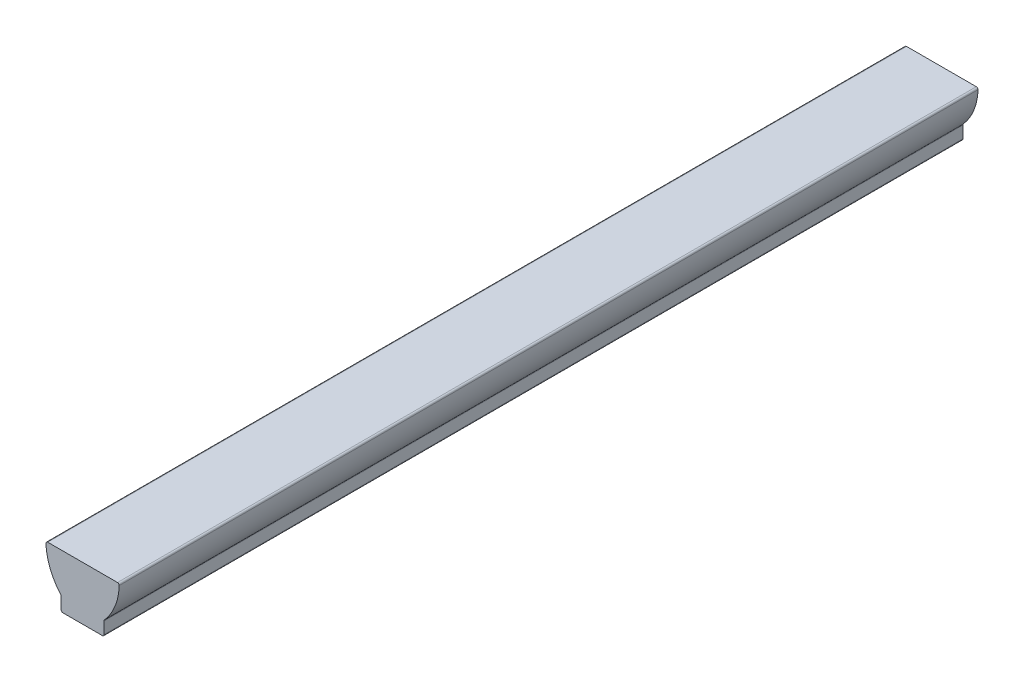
ISO-10303-21;
HEADER;
FILE_DESCRIPTION(('STEP AP214'),'2;1');
FILE_NAME('part.step','',(''),(''),'','','');
FILE_SCHEMA(('AUTOMOTIVE_DESIGN { 1 0 10303 214 1 1 1 1 }'));
ENDSEC;
DATA;
#1=APPLICATION_CONTEXT('core data for automotive mechanical design processes');
#2=APPLICATION_PROTOCOL_DEFINITION('international standard','automotive_design',2000,#1);
#3=PRODUCT_CONTEXT('',#1,'mechanical');
#4=PRODUCT('Part','Part','',(#3));
#5=PRODUCT_RELATED_PRODUCT_CATEGORY('part','',(#4));
#6=PRODUCT_DEFINITION_FORMATION('','',#4);
#7=PRODUCT_DEFINITION_CONTEXT('part definition',#1,'design');
#8=PRODUCT_DEFINITION('design','',#6,#7);
#9=PRODUCT_DEFINITION_SHAPE('','',#8);
#10=(LENGTH_UNIT() NAMED_UNIT(*) SI_UNIT(.MILLI.,.METRE.));
#11=(NAMED_UNIT(*) PLANE_ANGLE_UNIT() SI_UNIT($,.RADIAN.));
#12=(NAMED_UNIT(*) SI_UNIT($,.STERADIAN.) SOLID_ANGLE_UNIT());
#13=UNCERTAINTY_MEASURE_WITH_UNIT(LENGTH_MEASURE(1.E-05),#10,'distance_accuracy_value','');
#14=(GEOMETRIC_REPRESENTATION_CONTEXT(3) GLOBAL_UNCERTAINTY_ASSIGNED_CONTEXT((#13)) GLOBAL_UNIT_ASSIGNED_CONTEXT((#10,
#11,#12)) REPRESENTATION_CONTEXT('',''));
#15=CARTESIAN_POINT('',(0.,0.,0.));
#16=DIRECTION('',(0.,0.,1.));
#17=DIRECTION('',(1.,0.,0.));
#18=AXIS2_PLACEMENT_3D('',#15,#16,#17);
#19=CARTESIAN_POINT('',(-4.38149999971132,-10.8769810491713,-0.254));
#20=CARTESIAN_POINT('',(-4.43202373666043,-10.8769810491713,-0.254));
#21=CARTESIAN_POINT('',(-4.48062453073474,-10.8673137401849,-0.254));
#22=CARTESIAN_POINT('',(-4.52730238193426,-10.8479791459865,-0.254));
#23=CARTESIAN_POINT('',(-4.57398023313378,-10.8286445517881,-0.254));
#24=CARTESIAN_POINT('',(-4.61518198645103,-10.8011144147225,-0.254));
#25=CARTESIAN_POINT('',(-4.6509076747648,-10.7653887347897,-0.254));
#26=CARTESIAN_POINT('',(-4.68663336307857,-10.7296630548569,-0.254));
#27=CARTESIAN_POINT('',(-4.714163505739,-10.6884612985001,-0.254));
#28=CARTESIAN_POINT('',(-4.73349810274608,-10.6417834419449,-0.254));
#29=CARTESIAN_POINT('',(-4.75283269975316,-10.5951055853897,-0.254));
#30=CARTESIAN_POINT('',(-4.7624999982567,-10.5465047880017,-0.254));
#31=CARTESIAN_POINT('',(-4.7624999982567,-10.4959810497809,-0.254));
#32=CARTESIAN_POINT('',(-4.38149999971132,-10.8769810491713,190.246));
#33=CARTESIAN_POINT('',(-4.43202373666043,-10.8769810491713,190.246));
#34=CARTESIAN_POINT('',(-4.48062453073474,-10.8673137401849,190.246));
#35=CARTESIAN_POINT('',(-4.52730238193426,-10.8479791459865,190.246));
#36=CARTESIAN_POINT('',(-4.57398023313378,-10.8286445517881,190.246));
#37=CARTESIAN_POINT('',(-4.61518198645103,-10.8011144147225,190.246));
#38=CARTESIAN_POINT('',(-4.6509076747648,-10.7653887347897,190.246));
#39=CARTESIAN_POINT('',(-4.68663336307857,-10.7296630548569,190.246));
#40=CARTESIAN_POINT('',(-4.714163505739,-10.6884612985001,190.246));
#41=CARTESIAN_POINT('',(-4.73349810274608,-10.6417834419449,190.246));
#42=CARTESIAN_POINT('',(-4.75283269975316,-10.5951055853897,190.246));
#43=CARTESIAN_POINT('',(-4.7624999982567,-10.5465047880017,190.246));
#44=CARTESIAN_POINT('',(-4.7624999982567,-10.4959810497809,190.246));
#45=B_SPLINE_SURFACE_WITH_KNOTS('',1,3,((#19,#20,#21,#22,#23,#24,#25,#26,#27,#28,#29,#30,#31),
(#32,#33,#34,#35,#36,#37,#38,#39,#40,#41,#42,#43,#44)),.UNSPECIFIED.,.F.,.F.,.F.,(2,2),(4,3,3,3,
4),(0.,1.),(0.,0.25,0.5,0.75,1.),.UNSPECIFIED.);
#46=CARTESIAN_POINT('',(-4.38149999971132,-10.8769810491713,190.246));
#47=CARTESIAN_POINT('',(-4.3922435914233,-10.876985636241,190.246));
#48=CARTESIAN_POINT('',(-4.40298912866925,-10.8765442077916,190.246));
#49=CARTESIAN_POINT('',(-4.42440047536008,-10.8747577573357,190.246));
#50=CARTESIAN_POINT('',(-4.43506631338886,-10.8734130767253,190.246));
#51=CARTESIAN_POINT('',(-4.45623656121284,-10.8698096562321,190.246));
#52=CARTESIAN_POINT('',(-4.46674106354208,-10.8675514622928,190.246));
#53=CARTESIAN_POINT('',(-4.48751782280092,-10.8621412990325,190.246));
#54=CARTESIAN_POINT('',(-4.49779005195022,-10.8589892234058,190.246));
#55=CARTESIAN_POINT('',(-4.51803734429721,-10.8518411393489,190.246));
#56=CARTESIAN_POINT('',(-4.52801238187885,-10.8478450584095,190.246));
#57=CARTESIAN_POINT('',(-4.54759980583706,-10.8390520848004,190.246));
#58=CARTESIAN_POINT('',(-4.55721221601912,-10.8342552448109,190.246));
#59=CARTESIAN_POINT('',(-4.58536995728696,-10.8186480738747,190.246));
#60=CARTESIAN_POINT('',(-4.60325702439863,-10.806613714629,190.246));
#61=CARTESIAN_POINT('',(-4.63668899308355,-10.7797444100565,190.246));
#62=CARTESIAN_POINT('',(-4.65223934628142,-10.7649161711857,190.246));
#63=CARTESIAN_POINT('',(-4.68069426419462,-10.7328885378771,190.246));
#64=CARTESIAN_POINT('',(-4.69359821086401,-10.715688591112,190.246));
#65=CARTESIAN_POINT('',(-4.7162729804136,-10.6792732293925,190.246));
#66=CARTESIAN_POINT('',(-4.72603481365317,-10.6600522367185,190.246));
#67=CARTESIAN_POINT('',(-4.74229159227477,-10.6202831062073,190.246));
#68=CARTESIAN_POINT('',(-4.74878865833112,-10.5997358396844,190.246));
#69=CARTESIAN_POINT('',(-4.75649596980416,-10.565202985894,190.246));
#70=CARTESIAN_POINT('',(-4.75876152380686,-10.5514465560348,190.246));
#71=CARTESIAN_POINT('',(-4.76176772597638,-10.5237867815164,190.246));
#72=CARTESIAN_POINT('',(-4.76251047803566,-10.5098836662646,190.246));
#73=CARTESIAN_POINT('',(-4.7624999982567,-10.4959810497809,190.246));
#74=B_SPLINE_CURVE_WITH_KNOTS('',3,(#46,#47,#48,#49,#50,#51,#52,#53,#54,#55,#56,#57,#58,#59,#60,
#61,#62,#63,#64,#65,#66,#67,#68,#69,#70,#71,#72,#73),.UNSPECIFIED.,.F.,.F.,(4,2,2,2,2,2,2,2,2,2,
2,2,2,4),(0.,0.0322242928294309,0.064436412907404,0.0966293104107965,0.128826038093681,
0.161025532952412,0.193222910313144,0.257551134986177,0.321726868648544,0.385917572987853,
0.450290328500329,0.514621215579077,0.556364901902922,0.598050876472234),.UNSPECIFIED.);
#75=CARTESIAN_POINT('',(-4.38149999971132,-10.8769810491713,190.246));
#76=VERTEX_POINT('',#75);
#77=CARTESIAN_POINT('',(-4.7624999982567,-10.4959810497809,190.246));
#78=VERTEX_POINT('',#77);
#79=EDGE_CURVE('E150',#76,#78,#74,.T.);
#80=DIRECTION('',(0.,0.,1.));
#81=VECTOR('',#80,1.);
#82=CARTESIAN_POINT('',(-4.7624999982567,-10.4959810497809,94.996));
#83=LINE('',#82,#81);
#84=CARTESIAN_POINT('',(-4.7624999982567,-10.4959810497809,-0.25400000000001));
#85=VERTEX_POINT('',#84);
#86=EDGE_CURVE('E145',#85,#78,#83,.T.);
#87=CARTESIAN_POINT('',(-4.38149999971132,-10.8769810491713,-0.254));
#88=CARTESIAN_POINT('',(-4.3922435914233,-10.876985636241,-0.254));
#89=CARTESIAN_POINT('',(-4.40298912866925,-10.8765442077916,-0.254));
#90=CARTESIAN_POINT('',(-4.42440047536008,-10.8747577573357,-0.254));
#91=CARTESIAN_POINT('',(-4.43506631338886,-10.8734130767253,-0.254));
#92=CARTESIAN_POINT('',(-4.45623656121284,-10.8698096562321,-0.254));
#93=CARTESIAN_POINT('',(-4.46674106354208,-10.8675514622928,-0.254));
#94=CARTESIAN_POINT('',(-4.48751782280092,-10.8621412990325,-0.254));
#95=CARTESIAN_POINT('',(-4.49779005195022,-10.8589892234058,-0.254));
#96=CARTESIAN_POINT('',(-4.51803734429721,-10.8518411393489,-0.254));
#97=CARTESIAN_POINT('',(-4.52801238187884,-10.8478450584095,-0.254));
#98=CARTESIAN_POINT('',(-4.54759980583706,-10.8390520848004,-0.254));
#99=CARTESIAN_POINT('',(-4.55721221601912,-10.8342552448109,-0.254));
#100=CARTESIAN_POINT('',(-4.58536995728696,-10.8186480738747,-0.254));
#101=CARTESIAN_POINT('',(-4.60325702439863,-10.806613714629,-0.254));
#102=CARTESIAN_POINT('',(-4.63668899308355,-10.7797444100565,-0.254));
#103=CARTESIAN_POINT('',(-4.65223934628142,-10.7649161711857,-0.254));
#104=CARTESIAN_POINT('',(-4.68069426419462,-10.7328885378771,-0.254));
#105=CARTESIAN_POINT('',(-4.69359821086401,-10.715688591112,-0.254));
#106=CARTESIAN_POINT('',(-4.7162729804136,-10.6792732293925,-0.254));
#107=CARTESIAN_POINT('',(-4.72603481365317,-10.6600522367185,-0.254));
#108=CARTESIAN_POINT('',(-4.74229159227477,-10.6202831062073,-0.254));
#109=CARTESIAN_POINT('',(-4.74878865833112,-10.5997358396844,-0.254));
#110=CARTESIAN_POINT('',(-4.75649596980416,-10.565202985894,-0.254));
#111=CARTESIAN_POINT('',(-4.75876152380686,-10.5514465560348,-0.254));
#112=CARTESIAN_POINT('',(-4.76176772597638,-10.5237867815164,-0.254));
#113=CARTESIAN_POINT('',(-4.76251047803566,-10.5098836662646,-0.254));
#114=CARTESIAN_POINT('',(-4.7624999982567,-10.4959810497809,-0.254));
#115=B_SPLINE_CURVE_WITH_KNOTS('',3,(#87,#88,#89,#90,#91,#92,#93,#94,#95,#96,#97,#98,#99,#100,
#101,#102,#103,#104,#105,#106,#107,#108,#109,#110,#111,#112,#113,#114),.UNSPECIFIED.,.F.,.F.,(4,
2,2,2,2,2,2,2,2,2,2,2,2,4),(0.,0.0322242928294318,0.064436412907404,0.096629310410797,
0.128826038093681,0.161025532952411,0.193222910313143,0.257551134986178,0.321726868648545,
0.385917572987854,0.450290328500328,0.514621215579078,0.556364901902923,0.598050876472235),.UNSPECIFIED.);
#116=CARTESIAN_POINT('',(-4.38149999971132,-10.8769810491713,-0.254000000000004));
#117=VERTEX_POINT('',#116);
#118=EDGE_CURVE('E121',#117,#85,#115,.T.);
#119=DIRECTION('',(0.,0.,-1.));
#120=VECTOR('',#119,1.);
#121=CARTESIAN_POINT('',(-4.38149999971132,-10.8769810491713,94.996));
#122=LINE('',#121,#120);
#123=EDGE_CURVE('E113',#76,#117,#122,.T.);
#124=ORIENTED_EDGE('',*,*,#79,.T.);
#125=ORIENTED_EDGE('',*,*,#86,.F.);
#126=ORIENTED_EDGE('',*,*,#118,.F.);
#127=ORIENTED_EDGE('',*,*,#123,.F.);
#128=EDGE_LOOP('',(#124,#125,#126,#127));
#129=FACE_BOUND('',#128,.T.);
#130=ADVANCED_FACE('F14',(#129),#45,.T.);
#131=CARTESIAN_POINT('',(-5.14350017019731,-7.84793773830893,-0.254000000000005));
#132=DIRECTION('',(0.,0.,1.));
#133=DIRECTION('',(0.,-1.,0.));
#134=AXIS2_PLACEMENT_3D('',#131,#132,#133);
#135=CYLINDRICAL_SURFACE('',#134,0.381000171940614);
#136=CARTESIAN_POINT('',(-5.1435001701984,-7.84793773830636,190.246));
#137=DIRECTION('',(0.,0.,1.));
#138=DIRECTION('',(0.,-1.,0.));
#139=AXIS2_PLACEMENT_3D('',#136,#137,#138);
#140=CIRCLE('',#139,0.381000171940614);
#141=CARTESIAN_POINT('',(-4.7624999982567,-7.84793773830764,190.246));
#142=VERTEX_POINT('',#141);
#143=CARTESIAN_POINT('',(-4.85861895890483,-7.59494799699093,190.246));
#144=VERTEX_POINT('',#143);
#145=EDGE_CURVE('E149',#142,#144,#140,.T.);
#146=ORIENTED_EDGE('',*,*,#145,.T.);
#147=DIRECTION('',(0.,0.,1.));
#148=VECTOR('',#147,1.);
#149=CARTESIAN_POINT('',(-4.85861897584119,-7.59494801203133,94.996));
#150=LINE('',#149,#148);
#151=CARTESIAN_POINT('',(-4.85861897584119,-7.59494801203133,-0.254000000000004));
#152=VERTEX_POINT('',#151);
#153=EDGE_CURVE('E144',#152,#144,#150,.T.);
#154=ORIENTED_EDGE('',*,*,#153,.F.);
#155=CARTESIAN_POINT('',(-5.14350017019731,-7.84793773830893,-0.254000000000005));
#156=DIRECTION('',(0.,0.,1.));
#157=DIRECTION('',(0.,-1.,0.));
#158=AXIS2_PLACEMENT_3D('',#155,#156,#157);
#159=CIRCLE('',#158,0.381000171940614);
#160=CARTESIAN_POINT('',(-4.7624999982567,-7.84793773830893,-0.25400000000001));
#161=VERTEX_POINT('',#160);
#162=EDGE_CURVE('E159',#161,#152,#159,.T.);
#163=ORIENTED_EDGE('',*,*,#162,.F.);
#164=DIRECTION('',(0.,0.,-1.));
#165=VECTOR('',#164,1.);
#166=CARTESIAN_POINT('',(-4.7624999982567,-7.84793773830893,94.996));
#167=LINE('',#166,#165);
#168=EDGE_CURVE('E141',#142,#161,#167,.T.);
#169=ORIENTED_EDGE('',*,*,#168,.F.);
#170=EDGE_LOOP('',(#146,#154,#163,#169));
#171=FACE_BOUND('',#170,.T.);
#172=ADVANCED_FACE('F247',(#171),#135,.F.);
#173=CARTESIAN_POINT('',(4.7624999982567,-10.4959810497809,-0.254));
#174=CARTESIAN_POINT('',(4.7624999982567,-10.5465047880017,-0.254));
#175=CARTESIAN_POINT('',(4.75283269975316,-10.5951055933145,-0.254));
#176=CARTESIAN_POINT('',(4.73349810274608,-10.6417834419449,-0.254));
#177=CARTESIAN_POINT('',(4.714163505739,-10.6884612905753,-0.254));
#178=CARTESIAN_POINT('',(4.68663335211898,-10.7296630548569,-0.254000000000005));
#179=CARTESIAN_POINT('',(4.6509076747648,-10.7653887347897,-0.254000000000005));
#180=CARTESIAN_POINT('',(4.61518199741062,-10.8011144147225,-0.254000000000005));
#181=CARTESIAN_POINT('',(4.57398023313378,-10.8286445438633,-0.254000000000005));
#182=CARTESIAN_POINT('',(4.52730238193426,-10.8479791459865,-0.254000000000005));
#183=CARTESIAN_POINT('',(4.48062453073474,-10.8673137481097,-0.254000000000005));
#184=CARTESIAN_POINT('',(4.43202373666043,-10.8769810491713,-0.254));
#185=CARTESIAN_POINT('',(4.38149999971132,-10.8769810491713,-0.254));
#186=CARTESIAN_POINT('',(4.7624999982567,-10.4959810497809,190.246));
#187=CARTESIAN_POINT('',(4.7624999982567,-10.5465047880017,190.246));
#188=CARTESIAN_POINT('',(4.75283269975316,-10.5951055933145,190.246));
#189=CARTESIAN_POINT('',(4.73349810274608,-10.6417834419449,190.246));
#190=CARTESIAN_POINT('',(4.714163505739,-10.6884612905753,190.246));
#191=CARTESIAN_POINT('',(4.68663335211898,-10.7296630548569,190.246));
#192=CARTESIAN_POINT('',(4.6509076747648,-10.7653887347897,190.246));
#193=CARTESIAN_POINT('',(4.61518199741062,-10.8011144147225,190.246));
#194=CARTESIAN_POINT('',(4.57398023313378,-10.8286445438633,190.246));
#195=CARTESIAN_POINT('',(4.52730238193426,-10.8479791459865,190.246));
#196=CARTESIAN_POINT('',(4.48062453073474,-10.8673137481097,190.246));
#197=CARTESIAN_POINT('',(4.43202373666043,-10.8769810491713,190.246));
#198=CARTESIAN_POINT('',(4.38149999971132,-10.8769810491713,190.246));
#199=B_SPLINE_SURFACE_WITH_KNOTS('',1,3,((#173,#174,#175,#176,#177,#178,#179,#180,#181,#182,
#183,#184,#185),(#186,#187,#188,#189,#190,#191,#192,#193,#194,#195,#196,#197,#198)),
.UNSPECIFIED.,.F.,.F.,.F.,(2,2),(4,3,3,3,4),(0.,1.),(0.,0.25,0.5,0.75,1.),.UNSPECIFIED.);
#200=CARTESIAN_POINT('',(4.7624999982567,-10.4959810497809,190.246));
#201=CARTESIAN_POINT('',(4.76250458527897,-10.5067246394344,190.246));
#202=CARTESIAN_POINT('',(4.76206315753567,-10.517470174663,190.246));
#203=CARTESIAN_POINT('',(4.76027670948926,-10.538881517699,190.246));
#204=CARTESIAN_POINT('',(4.75893203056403,-10.5495473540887,190.246));
#205=CARTESIAN_POINT('',(4.75532861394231,-10.5707175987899,190.246));
#206=CARTESIAN_POINT('',(4.7530704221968,-10.5812220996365,190.246));
#207=CARTESIAN_POINT('',(4.74766026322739,-10.6019988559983,190.246));
#208=CARTESIAN_POINT('',(4.74450818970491,-10.612271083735,190.246));
#209=CARTESIAN_POINT('',(4.73736010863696,-10.6325183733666,190.246));
#210=CARTESIAN_POINT('',(4.73336402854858,-10.6424934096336,190.246));
#211=CARTESIAN_POINT('',(4.72457105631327,-10.6620808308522,190.246));
#212=CARTESIAN_POINT('',(4.71977421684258,-10.6716932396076,190.246));
#213=CARTESIAN_POINT('',(4.70416704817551,-10.6998509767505,190.246));
#214=CARTESIAN_POINT('',(4.6921326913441,-10.7177380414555,190.246));
#215=CARTESIAN_POINT('',(4.66526339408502,-10.7511700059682,190.246));
#216=CARTESIAN_POINT('',(4.65043516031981,-10.7667203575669,190.246));
#217=CARTESIAN_POINT('',(4.6184075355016,-10.7951752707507,190.246));
#218=CARTESIAN_POINT('',(4.60120759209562,-10.8080792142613,190.246));
#219=CARTESIAN_POINT('',(4.56479224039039,-10.8307539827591,190.246));
#220=CARTESIAN_POINT('',(4.54557125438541,-10.8405158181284,190.246));
#221=CARTESIAN_POINT('',(4.50580213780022,-10.85677260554,190.246));
#222=CARTESIAN_POINT('',(4.48525487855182,-10.8632696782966,190.246));
#223=CARTESIAN_POINT('',(4.4507220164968,-10.8709770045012,190.246));
#224=CARTESIAN_POINT('',(4.43696557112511,-10.8732425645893,190.246));
#225=CARTESIAN_POINT('',(4.40930576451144,-10.8762487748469,190.246));
#226=CARTESIAN_POINT('',(4.39540263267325,-10.8769915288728,190.246));
#227=CARTESIAN_POINT('',(4.38149999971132,-10.8769810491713,190.246));
#228=B_SPLINE_CURVE_WITH_KNOTS('',3,(#200,#201,#202,#203,#204,#205,#206,#207,#208,#209,#210,
#211,#212,#213,#214,#215,#216,#217,#218,#219,#220,#221,#222,#223,#224,#225,#226,#227),
.UNSPECIFIED.,.F.,.F.,(4,2,2,2,2,2,2,2,2,2,2,2,2,4),(0.,0.032224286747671,0.0644364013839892,
0.0966292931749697,0.128826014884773,0.16102550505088,0.193222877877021,0.25755109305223,
0.32172681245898,0.385917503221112,0.450290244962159,0.514621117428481,0.556364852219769,
0.598050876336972),.UNSPECIFIED.);
#229=CARTESIAN_POINT('',(4.7624999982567,-10.4959810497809,190.246));
#230=VERTEX_POINT('',#229);
#231=CARTESIAN_POINT('',(4.38149999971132,-10.8769810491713,190.246));
#232=VERTEX_POINT('',#231);
#233=EDGE_CURVE('E109',#230,#232,#228,.T.);
#234=DIRECTION('',(0.,0.,1.));
#235=VECTOR('',#234,1.);
#236=CARTESIAN_POINT('',(4.38149999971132,-10.8769810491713,94.996));
#237=LINE('',#236,#235);
#238=CARTESIAN_POINT('',(4.38149999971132,-10.8769810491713,-0.254000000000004));
#239=VERTEX_POINT('',#238);
#240=EDGE_CURVE('E105',#239,#232,#237,.T.);
#241=CARTESIAN_POINT('',(4.7624999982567,-10.4959810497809,-0.254));
#242=CARTESIAN_POINT('',(4.76250458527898,-10.5067246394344,-0.254));
#243=CARTESIAN_POINT('',(4.76206315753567,-10.517470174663,-0.254));
#244=CARTESIAN_POINT('',(4.76027670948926,-10.538881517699,-0.254));
#245=CARTESIAN_POINT('',(4.75893203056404,-10.5495473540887,-0.254));
#246=CARTESIAN_POINT('',(4.75532861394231,-10.5707175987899,-0.254));
#247=CARTESIAN_POINT('',(4.7530704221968,-10.5812220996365,-0.254));
#248=CARTESIAN_POINT('',(4.74766026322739,-10.6019988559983,-0.254));
#249=CARTESIAN_POINT('',(4.74450818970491,-10.612271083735,-0.254));
#250=CARTESIAN_POINT('',(4.73736010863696,-10.6325183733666,-0.254));
#251=CARTESIAN_POINT('',(4.73336402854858,-10.6424934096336,-0.254));
#252=CARTESIAN_POINT('',(4.72457105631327,-10.6620808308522,-0.254));
#253=CARTESIAN_POINT('',(4.71977421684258,-10.6716932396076,-0.253999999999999));
#254=CARTESIAN_POINT('',(4.70416704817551,-10.6998509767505,-0.254000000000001));
#255=CARTESIAN_POINT('',(4.6921326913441,-10.7177380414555,-0.254000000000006));
#256=CARTESIAN_POINT('',(4.66526339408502,-10.7511700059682,-0.254000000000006));
#257=CARTESIAN_POINT('',(4.65043516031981,-10.7667203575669,-0.254));
#258=CARTESIAN_POINT('',(4.6184075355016,-10.7951752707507,-0.254));
#259=CARTESIAN_POINT('',(4.60120759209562,-10.8080792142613,-0.254000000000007));
#260=CARTESIAN_POINT('',(4.56479224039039,-10.8307539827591,-0.254000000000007));
#261=CARTESIAN_POINT('',(4.54557125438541,-10.8405158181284,-0.254));
#262=CARTESIAN_POINT('',(4.50580213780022,-10.85677260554,-0.254));
#263=CARTESIAN_POINT('',(4.48525487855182,-10.8632696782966,-0.254000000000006));
#264=CARTESIAN_POINT('',(4.4507220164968,-10.8709770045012,-0.254000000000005));
#265=CARTESIAN_POINT('',(4.43696557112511,-10.8732425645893,-0.254000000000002));
#266=CARTESIAN_POINT('',(4.40930576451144,-10.8762487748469,-0.253999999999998));
#267=CARTESIAN_POINT('',(4.39540263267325,-10.8769915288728,-0.253999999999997));
#268=CARTESIAN_POINT('',(4.38149999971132,-10.8769810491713,-0.254));
#269=B_SPLINE_CURVE_WITH_KNOTS('',3,(#241,#242,#243,#244,#245,#246,#247,#248,#249,#250,#251,
#252,#253,#254,#255,#256,#257,#258,#259,#260,#261,#262,#263,#264,#265,#266,#267,#268),
.UNSPECIFIED.,.F.,.F.,(4,2,2,2,2,2,2,2,2,2,2,2,2,4),(0.,0.0322242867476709,0.0644364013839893,
0.0966292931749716,0.128826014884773,0.16102550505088,0.193222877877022,0.25755109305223,
0.321726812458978,0.385917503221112,0.450290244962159,0.51462111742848,0.556364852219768,
0.598050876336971),.UNSPECIFIED.);
#270=CARTESIAN_POINT('',(4.7624999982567,-10.4959810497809,-0.254000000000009));
#271=VERTEX_POINT('',#270);
#272=EDGE_CURVE('E20',#271,#239,#269,.T.);
#273=DIRECTION('',(0.,0.,-1.));
#274=VECTOR('',#273,1.);
#275=CARTESIAN_POINT('',(4.7624999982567,-10.4959810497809,94.996));
#276=LINE('',#275,#274);
#277=EDGE_CURVE('E131',#230,#271,#276,.T.);
#278=ORIENTED_EDGE('',*,*,#233,.T.);
#279=ORIENTED_EDGE('',*,*,#240,.F.);
#280=ORIENTED_EDGE('',*,*,#272,.F.);
#281=ORIENTED_EDGE('',*,*,#277,.F.);
#282=EDGE_LOOP('',(#278,#279,#280,#281));
#283=FACE_BOUND('',#282,.T.);
#284=ADVANCED_FACE('F107',(#283),#199,.T.);
#285=CARTESIAN_POINT('',(4.38149999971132,-10.8769810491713,-0.254));
#286=DIRECTION('',(0.,-1.,0.));
#287=DIRECTION('',(0.,0.,1.));
#288=AXIS2_PLACEMENT_3D('',#285,#286,#287);
#289=PLANE('',#288);
#290=DIRECTION('',(-1.,0.,0.));
#291=VECTOR('',#290,1.);
#292=CARTESIAN_POINT('',(0.0010831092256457,-10.8769810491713,190.246));
#293=LINE('',#292,#291);
#294=EDGE_CURVE('E152',#232,#76,#293,.T.);
#295=ORIENTED_EDGE('',*,*,#294,.T.);
#296=ORIENTED_EDGE('',*,*,#123,.T.);
#297=DIRECTION('',(-1.,0.,0.));
#298=VECTOR('',#297,1.);
#299=CARTESIAN_POINT('',(0.0010831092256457,-10.8769810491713,-0.254));
#300=LINE('',#299,#298);
#301=EDGE_CURVE('E117',#239,#117,#300,.T.);
#302=ORIENTED_EDGE('',*,*,#301,.F.);
#303=ORIENTED_EDGE('',*,*,#240,.T.);
#304=EDGE_LOOP('',(#295,#296,#302,#303));
#305=FACE_BOUND('',#304,.T.);
#306=ADVANCED_FACE('F118',(#305),#289,.T.);
#307=CARTESIAN_POINT('',(-4.7624999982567,-10.4959810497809,-0.254));
#308=DIRECTION('',(-1.,0.,0.));
#309=DIRECTION('',(0.,0.,1.));
#310=AXIS2_PLACEMENT_3D('',#307,#308,#309);
#311=PLANE('',#310);
#312=DIRECTION('',(0.,1.,0.));
#313=VECTOR('',#312,1.);
#314=CARTESIAN_POINT('',(-4.7624999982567,-4.93338104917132,190.246));
#315=LINE('',#314,#313);
#316=EDGE_CURVE('E146',#78,#142,#315,.T.);
#317=ORIENTED_EDGE('',*,*,#316,.T.);
#318=ORIENTED_EDGE('',*,*,#168,.T.);
#319=DIRECTION('',(0.,1.,0.));
#320=VECTOR('',#319,1.);
#321=CARTESIAN_POINT('',(-4.7624999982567,-4.93338104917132,-0.254));
#322=LINE('',#321,#320);
#323=EDGE_CURVE('E157',#85,#161,#322,.T.);
#324=ORIENTED_EDGE('',*,*,#323,.F.);
#325=ORIENTED_EDGE('',*,*,#86,.T.);
#326=EDGE_LOOP('',(#317,#318,#324,#325));
#327=FACE_BOUND('',#326,.T.);
#328=ADVANCED_FACE('F334',(#327),#311,.T.);
#329=CARTESIAN_POINT('',(-4.85861897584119,-7.59494801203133,-0.254));
#330=CARTESIAN_POINT('',(-5.35889559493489,-7.03160765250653,-0.254));
#331=CARTESIAN_POINT('',(-5.80664104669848,-6.42922159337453,-0.254));
#332=CARTESIAN_POINT('',(-6.20185533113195,-5.78778981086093,-0.254));
#333=CARTESIAN_POINT('',(-6.59706961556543,-5.14635802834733,-0.254));
#334=CARTESIAN_POINT('',(-6.9337870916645,-4.47556274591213,-0.254));
#335=CARTESIAN_POINT('',(-7.21200775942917,-3.77540396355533,-0.254));
#336=CARTESIAN_POINT('',(-7.49022842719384,-3.07524518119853,-0.254));
#337=CARTESIAN_POINT('',(-7.70575261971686,-2.35629157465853,-0.254));
#338=CARTESIAN_POINT('',(-7.85858036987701,-1.61854314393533,-0.254));
#339=CARTESIAN_POINT('',(-8.01140812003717,-0.880794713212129,-0.254));
#340=CARTESIAN_POINT('',(-8.09923251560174,-0.13538754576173,-0.254));
#341=CARTESIAN_POINT('',(-8.12205355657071,0.61767835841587,-0.254));
#342=CARTESIAN_POINT('',(-8.12296639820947,0.647800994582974,-0.254));
#343=CARTESIAN_POINT('',(-8.12387923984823,0.677923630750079,-0.254));
#344=CARTESIAN_POINT('',(-8.12479208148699,0.708046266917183,-0.254));
#345=CARTESIAN_POINT('',(-4.85861897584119,-7.59494801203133,190.246));
#346=CARTESIAN_POINT('',(-5.35889559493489,-7.03160765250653,190.246));
#347=CARTESIAN_POINT('',(-5.80664104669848,-6.42922159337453,190.246));
#348=CARTESIAN_POINT('',(-6.20185533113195,-5.78778981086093,190.246));
#349=CARTESIAN_POINT('',(-6.59706961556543,-5.14635802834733,190.246));
#350=CARTESIAN_POINT('',(-6.9337870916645,-4.47556274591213,190.246));
#351=CARTESIAN_POINT('',(-7.21200775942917,-3.77540396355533,190.246));
#352=CARTESIAN_POINT('',(-7.49022842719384,-3.07524518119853,190.246));
#353=CARTESIAN_POINT('',(-7.70575261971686,-2.35629157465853,190.246));
#354=CARTESIAN_POINT('',(-7.85858036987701,-1.61854314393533,190.246));
#355=CARTESIAN_POINT('',(-8.01140812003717,-0.880794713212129,190.246));
#356=CARTESIAN_POINT('',(-8.09923251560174,-0.13538754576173,190.246));
#357=CARTESIAN_POINT('',(-8.12205355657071,0.61767835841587,190.246));
#358=CARTESIAN_POINT('',(-8.12296639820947,0.647800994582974,190.246));
#359=CARTESIAN_POINT('',(-8.12387923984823,0.677923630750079,190.246));
#360=CARTESIAN_POINT('',(-8.12479208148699,0.708046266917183,190.246));
#361=B_SPLINE_SURFACE_WITH_KNOTS('',1,3,((#329,#330,#331,#332,#333,#334,#335,#336,#337,#338,
#339,#340,#341,#342,#343,#344),(#345,#346,#347,#348,#349,#350,#351,#352,#353,#354,#355,#356,
#357,#358,#359,#360)),.UNSPECIFIED.,.F.,.F.,.F.,(2,2),(4,3,3,3,3,4),(0.,1.),(0.,0.25,0.5,0.75,
1.,1.01),.UNSPECIFIED.);
#362=CARTESIAN_POINT('',(-4.85861897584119,-7.59494801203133,190.246));
#363=CARTESIAN_POINT('',(-4.98422799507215,-7.45351437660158,190.246));
#364=CARTESIAN_POINT('',(-5.10673859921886,-7.30935877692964,190.246));
#365=CARTESIAN_POINT('',(-5.34530322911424,-7.01585634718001,190.246));
#366=CARTESIAN_POINT('',(-5.46135874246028,-6.8665107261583,190.246));
#367=CARTESIAN_POINT('',(-5.79998646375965,-6.41036389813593,190.246));
#368=CARTESIAN_POINT('',(-6.0125187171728,-6.09601657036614,190.246));
#369=CARTESIAN_POINT('',(-6.40161787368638,-5.46263521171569,190.246));
#370=CARTESIAN_POINT('',(-6.57926315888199,-5.14426057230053,190.246));
#371=CARTESIAN_POINT('',(-6.90701813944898,-4.49346205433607,190.246));
#372=CARTESIAN_POINT('',(-7.05711669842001,-4.16103256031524,190.246));
#373=CARTESIAN_POINT('',(-7.32894755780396,-3.48473955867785,190.246));
#374=CARTESIAN_POINT('',(-7.45067762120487,-3.14087515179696,190.246));
#375=CARTESIAN_POINT('',(-7.66451728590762,-2.44422534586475,190.246));
#376=CARTESIAN_POINT('',(-7.75663842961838,-2.09144348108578,190.246));
#377=CARTESIAN_POINT('',(-7.9179325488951,-1.34733107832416,190.246));
#378=CARTESIAN_POINT('',(-7.98430091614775,-0.955384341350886,190.246));
#379=CARTESIAN_POINT('',(-8.05647763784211,-0.364697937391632,190.246));
#380=CARTESIAN_POINT('',(-8.07596803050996,-0.167540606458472,190.246));
#381=CARTESIAN_POINT('',(-8.10589180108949,0.227505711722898,190.246));
#382=CARTESIAN_POINT('',(-8.11632311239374,0.425394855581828,190.246));
#383=CARTESIAN_POINT('',(-8.12222834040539,0.623446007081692,190.246));
#384=B_SPLINE_CURVE_WITH_KNOTS('',3,(#362,#363,#364,#365,#366,#367,#368,#369,#370,#371,#372,
#373,#374,#375,#376,#377,#378,#379,#380,#381,#382,#383),.UNSPECIFIED.,.F.,.F.,(4,2,2,2,2,2,2,2,
2,2,4),(0.,0.567386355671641,1.13464140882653,2.27140664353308,3.36389692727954,
4.45682790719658,5.54984504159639,6.64243556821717,7.83316822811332,8.42734349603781,
9.02165427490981),.UNSPECIFIED.);
#385=CARTESIAN_POINT('',(-8.12214096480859,0.623448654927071,190.246));
#386=VERTEX_POINT('',#385);
#387=EDGE_CURVE('E204',#144,#386,#384,.T.);
#388=CARTESIAN_POINT('',(-8.12222837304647,0.629218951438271,-0.254));
#389=CARTESIAN_POINT('',(-8.12222837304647,0.629218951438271,190.246));
#390=B_SPLINE_CURVE_WITH_KNOTS('',1,(#388,#389),.UNSPECIFIED.,.F.,.F.,(2,2),(0.,1.),.UNSPECIFIED.);
#391=CARTESIAN_POINT('',(-8.12214096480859,0.623448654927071,-0.254));
#392=VERTEX_POINT('',#391);
#393=EDGE_CURVE('E128',#392,#386,#390,.T.);
#394=CARTESIAN_POINT('',(-4.85861897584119,-7.59494801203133,-0.254));
#395=CARTESIAN_POINT('',(-4.98549745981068,-7.45208593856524,-0.254));
#396=CARTESIAN_POINT('',(-5.10921356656,-7.30644637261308,-0.254));
#397=CARTESIAN_POINT('',(-5.35005583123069,-7.00987287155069,-0.254));
#398=CARTESIAN_POINT('',(-5.46718350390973,-6.85894016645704,-0.254));
#399=CARTESIAN_POINT('',(-5.80882518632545,-6.39788058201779,-0.254));
#400=CARTESIAN_POINT('',(-6.02309046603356,-6.08006313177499,-0.254));
#401=CARTESIAN_POINT('',(-6.41308416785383,-5.4427000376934,-0.254));
#402=CARTESIAN_POINT('',(-6.5901773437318,-5.12398528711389,-0.254));
#403=CARTESIAN_POINT('',(-6.91679913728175,-4.47255327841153,-0.254));
#404=CARTESIAN_POINT('',(-7.06631668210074,-4.13983046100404,-0.254));
#405=CARTESIAN_POINT('',(-7.33695727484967,-3.46301212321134,-0.254));
#406=CARTESIAN_POINT('',(-7.45807904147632,-3.11891609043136,-0.254));
#407=CARTESIAN_POINT('',(-7.67068071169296,-2.42185412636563,-0.254));
#408=CARTESIAN_POINT('',(-7.76217224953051,-2.06889173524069,-0.254));
#409=CARTESIAN_POINT('',(-7.92132242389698,-1.3282672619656,-0.254));
#410=CARTESIAN_POINT('',(-7.98652163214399,-0.940069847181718,-0.254));
#411=CARTESIAN_POINT('',(-8.05746992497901,-0.355085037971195,-0.254));
#412=CARTESIAN_POINT('',(-8.07663846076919,-0.159838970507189,-0.254));
#413=CARTESIAN_POINT('',(-8.10609449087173,0.231367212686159,-0.254));
#414=CARTESIAN_POINT('',(-8.11637995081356,0.427327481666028,-0.254));
#415=CARTESIAN_POINT('',(-8.12222834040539,0.623446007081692,-0.254));
#416=B_SPLINE_CURVE_WITH_KNOTS('',3,(#394,#395,#396,#397,#398,#399,#400,#401,#402,#403,#404,
#405,#406,#407,#408,#409,#410,#411,#412,#413,#414,#415),.UNSPECIFIED.,.F.,.F.,(4,2,2,2,2,2,2,2,
2,2,4),(0.,0.573116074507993,1.14609983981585,2.29435053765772,3.38692907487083,4.4799453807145,
5.5730109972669,6.66564690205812,7.84476166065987,8.43314107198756,9.02165519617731),.UNSPECIFIED.);
#417=EDGE_CURVE('E309',#152,#392,#416,.T.);
#418=ORIENTED_EDGE('',*,*,#387,.T.);
#419=ORIENTED_EDGE('',*,*,#393,.F.);
#420=ORIENTED_EDGE('',*,*,#417,.F.);
#421=ORIENTED_EDGE('',*,*,#153,.T.);
#422=EDGE_LOOP('',(#418,#419,#420,#421));
#423=FACE_BOUND('',#422,.T.);
#424=ADVANCED_FACE('F308',(#423),#361,.T.);
#425=CARTESIAN_POINT('',(4.7624999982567,-7.84793773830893,-0.254));
#426=DIRECTION('',(1.,0.,0.));
#427=DIRECTION('',(0.,0.,1.));
#428=AXIS2_PLACEMENT_3D('',#425,#426,#427);
#429=PLANE('',#428);
#430=DIRECTION('',(0.,-1.,0.));
#431=VECTOR('',#430,1.);
#432=CARTESIAN_POINT('',(4.7624999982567,-4.93338104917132,190.246));
#433=LINE('',#432,#431);
#434=CARTESIAN_POINT('',(4.76249999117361,-7.84793773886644,190.246));
#435=VERTEX_POINT('',#434);
#436=EDGE_CURVE('E134',#435,#230,#433,.T.);
#437=ORIENTED_EDGE('',*,*,#436,.T.);
#438=ORIENTED_EDGE('',*,*,#277,.T.);
#439=DIRECTION('',(0.,-1.,0.));
#440=VECTOR('',#439,1.);
#441=CARTESIAN_POINT('',(4.7624999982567,-4.93338104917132,-0.254));
#442=LINE('',#441,#440);
#443=CARTESIAN_POINT('',(4.76249999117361,-7.84793773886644,-0.254));
#444=VERTEX_POINT('',#443);
#445=EDGE_CURVE('E127',#444,#271,#442,.T.);
#446=ORIENTED_EDGE('',*,*,#445,.F.);
#447=DIRECTION('',(0.,0.,-1.));
#448=VECTOR('',#447,1.);
#449=CARTESIAN_POINT('',(4.76249998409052,-7.84793773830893,94.996));
#450=LINE('',#449,#448);
#451=EDGE_CURVE('E292',#435,#444,#450,.T.);
#452=ORIENTED_EDGE('',*,*,#451,.F.);
#453=EDGE_LOOP('',(#437,#438,#446,#452));
#454=FACE_BOUND('',#453,.T.);
#455=ADVANCED_FACE('F182',(#454),#429,.T.);
#456=CARTESIAN_POINT('',(-8.12222837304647,0.619776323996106,-0.254));
#457=CARTESIAN_POINT('',(-8.12222837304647,0.622923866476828,-0.254));
#458=CARTESIAN_POINT('',(-8.12222837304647,0.626071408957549,-0.254));
#459=CARTESIAN_POINT('',(-8.12222837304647,0.629218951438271,-0.254));
#460=CARTESIAN_POINT('',(-8.12222837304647,0.67974268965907,-0.254));
#461=CARTESIAN_POINT('',(-8.11256107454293,0.728343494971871,-0.254));
#462=CARTESIAN_POINT('',(-8.09322647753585,0.77502134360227,-0.254));
#463=CARTESIAN_POINT('',(-8.07389188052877,0.82169919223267,-0.254));
#464=CARTESIAN_POINT('',(-8.04636175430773,0.862900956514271,-0.254));
#465=CARTESIAN_POINT('',(-8.01063606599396,0.898626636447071,-0.254));
#466=CARTESIAN_POINT('',(-7.97491037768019,0.934352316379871,-0.254));
#467=CARTESIAN_POINT('',(-7.93370859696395,0.96188244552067,-0.254));
#468=CARTESIAN_POINT('',(-7.88703075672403,0.98121704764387,-0.254));
#469=CARTESIAN_POINT('',(-7.8403529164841,1.00055164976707,-0.254));
#470=CARTESIAN_POINT('',(-7.79175212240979,1.01021895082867,-0.254));
#471=CARTESIAN_POINT('',(-7.74122837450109,1.01021895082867,-0.254));
#472=CARTESIAN_POINT('',(-8.12222837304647,0.619776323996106,190.246));
#473=CARTESIAN_POINT('',(-8.12222837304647,0.622923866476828,190.246));
#474=CARTESIAN_POINT('',(-8.12222837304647,0.626071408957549,190.246));
#475=CARTESIAN_POINT('',(-8.12222837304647,0.629218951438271,190.246));
#476=CARTESIAN_POINT('',(-8.12222837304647,0.67974268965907,190.246));
#477=CARTESIAN_POINT('',(-8.11256107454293,0.728343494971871,190.246));
#478=CARTESIAN_POINT('',(-8.09322647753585,0.77502134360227,190.246));
#479=CARTESIAN_POINT('',(-8.07389188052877,0.82169919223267,190.246));
#480=CARTESIAN_POINT('',(-8.04636175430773,0.862900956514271,190.246));
#481=CARTESIAN_POINT('',(-8.01063606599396,0.898626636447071,190.246));
#482=CARTESIAN_POINT('',(-7.97491037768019,0.934352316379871,190.246));
#483=CARTESIAN_POINT('',(-7.93370859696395,0.96188244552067,190.246));
#484=CARTESIAN_POINT('',(-7.88703075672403,0.98121704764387,190.246));
#485=CARTESIAN_POINT('',(-7.8403529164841,1.00055164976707,190.246));
#486=CARTESIAN_POINT('',(-7.79175212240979,1.01021895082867,190.246));
#487=CARTESIAN_POINT('',(-7.74122837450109,1.01021895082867,190.246));
#488=B_SPLINE_SURFACE_WITH_KNOTS('',1,3,((#456,#457,#458,#459,#460,#461,#462,#463,#464,#465,
#466,#467,#468,#469,#470,#471),(#472,#473,#474,#475,#476,#477,#478,#479,#480,#481,#482,#483,
#484,#485,#486,#487)),.UNSPECIFIED.,.F.,.F.,.F.,(2,2),(4,3,3,3,3,4),(0.,1.),
(-0.0155745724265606,0.,0.25,0.5,0.75,1.),.UNSPECIFIED.);
#489=CARTESIAN_POINT('',(-8.12222837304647,0.623448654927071,190.246));
#490=CARTESIAN_POINT('',(-8.12236718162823,0.634519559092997,190.246));
#491=CARTESIAN_POINT('',(-8.12205197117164,0.645600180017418,190.246));
#492=CARTESIAN_POINT('',(-8.12047901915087,0.667690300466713,190.246));
#493=CARTESIAN_POINT('',(-8.11922156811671,0.678699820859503,190.246));
#494=CARTESIAN_POINT('',(-8.11573070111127,0.70055828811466,190.246));
#495=CARTESIAN_POINT('',(-8.1134978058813,0.711407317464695,190.246));
#496=CARTESIAN_POINT('',(-8.10808034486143,0.732864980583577,190.246));
#497=CARTESIAN_POINT('',(-8.10489569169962,0.743473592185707,190.246));
#498=CARTESIAN_POINT('',(-8.09761592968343,0.76440691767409,190.246));
#499=CARTESIAN_POINT('',(-8.09351832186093,0.774730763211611,190.246));
#500=CARTESIAN_POINT('',(-8.08446783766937,0.794991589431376,190.246));
#501=CARTESIAN_POINT('',(-8.07951500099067,0.804928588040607,190.246));
#502=CARTESIAN_POINT('',(-8.06335829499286,0.834017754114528,190.246));
#503=CARTESIAN_POINT('',(-8.05084709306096,0.852474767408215,190.246));
#504=CARTESIAN_POINT('',(-8.03006193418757,0.877961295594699,190.246));
#505=CARTESIAN_POINT('',(-8.02294019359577,0.885966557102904,190.246));
#506=CARTESIAN_POINT('',(-8.00807065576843,0.901375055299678,190.246));
#507=CARTESIAN_POINT('',(-8.00032281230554,0.908778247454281,190.246));
#508=CARTESIAN_POINT('',(-7.97618160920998,0.929971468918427,190.246));
#509=CARTESIAN_POINT('',(-7.9588809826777,0.942756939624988,190.246));
#510=CARTESIAN_POINT('',(-7.922309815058,0.965186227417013,190.246));
#511=CARTESIAN_POINT('',(-7.90303422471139,0.974821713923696,190.246));
#512=CARTESIAN_POINT('',(-7.86317235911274,0.990816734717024,190.246));
#513=CARTESIAN_POINT('',(-7.84258700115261,0.997178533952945,190.246));
#514=CARTESIAN_POINT('',(-7.80841308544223,1.00456979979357,190.246));
#515=CARTESIAN_POINT('',(-7.79505533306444,1.00670141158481,190.246));
#516=CARTESIAN_POINT('',(-7.76820766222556,1.00952920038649,190.246));
#517=CARTESIAN_POINT('',(-7.75471796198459,1.01022744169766,190.246));
#518=CARTESIAN_POINT('',(-7.74122837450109,1.01021895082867,190.246));
#519=B_SPLINE_CURVE_WITH_KNOTS('',3,(#489,#490,#491,#492,#493,#494,#495,#496,#497,#498,#499,
#500,#501,#502,#503,#504,#505,#506,#507,#508,#509,#510,#511,#512,#513,#514,#515,#516,#517,#518),
.UNSPECIFIED.,.F.,.F.,(4,2,2,2,2,2,2,2,2,2,2,2,2,2,4),(0.,0.033212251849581,0.0664142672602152,
0.0995985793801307,0.132785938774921,0.166065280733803,0.19934307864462,0.265815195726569,
0.297930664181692,0.330048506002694,0.394239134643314,0.458598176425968,0.522912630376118,
0.563419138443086,0.603867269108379),.UNSPECIFIED.);
#520=CARTESIAN_POINT('',(-7.74122837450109,1.01021895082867,190.246));
#521=VERTEX_POINT('',#520);
#522=EDGE_CURVE('E202',#386,#521,#519,.T.);
#523=DIRECTION('',(0.,0.,1.));
#524=VECTOR('',#523,1.);
#525=CARTESIAN_POINT('',(-7.74122837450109,1.01021895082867,94.996));
#526=LINE('',#525,#524);
#527=CARTESIAN_POINT('',(-7.74122837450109,1.01021895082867,-0.254000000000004));
#528=VERTEX_POINT('',#527);
#529=EDGE_CURVE('E136',#528,#521,#526,.T.);
#530=CARTESIAN_POINT('',(-8.12222837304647,0.623448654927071,-0.254));
#531=CARTESIAN_POINT('',(-8.12236718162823,0.634519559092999,-0.254));
#532=CARTESIAN_POINT('',(-8.12205197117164,0.645600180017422,-0.254));
#533=CARTESIAN_POINT('',(-8.12047901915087,0.667690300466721,-0.254));
#534=CARTESIAN_POINT('',(-8.11922156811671,0.678699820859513,-0.254));
#535=CARTESIAN_POINT('',(-8.11573070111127,0.700558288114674,-0.254));
#536=CARTESIAN_POINT('',(-8.11349780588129,0.711407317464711,-0.254));
#537=CARTESIAN_POINT('',(-8.10808034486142,0.732864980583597,-0.254));
#538=CARTESIAN_POINT('',(-8.10489569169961,0.743473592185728,-0.254));
#539=CARTESIAN_POINT('',(-8.09761592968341,0.764406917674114,-0.254));
#540=CARTESIAN_POINT('',(-8.09351832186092,0.774730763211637,-0.254));
#541=CARTESIAN_POINT('',(-8.08446783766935,0.794991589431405,-0.254));
#542=CARTESIAN_POINT('',(-8.07951500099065,0.804928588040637,-0.254));
#543=CARTESIAN_POINT('',(-8.06335829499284,0.834017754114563,-0.254));
#544=CARTESIAN_POINT('',(-8.05084709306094,0.852474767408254,-0.254));
#545=CARTESIAN_POINT('',(-8.03006193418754,0.877961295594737,-0.254));
#546=CARTESIAN_POINT('',(-8.02294019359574,0.885966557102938,-0.254));
#547=CARTESIAN_POINT('',(-8.00807065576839,0.90137505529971,-0.254));
#548=CARTESIAN_POINT('',(-8.00032281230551,0.908778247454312,-0.254));
#549=CARTESIAN_POINT('',(-7.97618160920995,0.929971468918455,-0.254));
#550=CARTESIAN_POINT('',(-7.95888098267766,0.942756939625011,-0.254));
#551=CARTESIAN_POINT('',(-7.92230981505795,0.965186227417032,-0.254));
#552=CARTESIAN_POINT('',(-7.90303422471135,0.974821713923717,-0.254));
#553=CARTESIAN_POINT('',(-7.86317235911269,0.990816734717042,-0.254));
#554=CARTESIAN_POINT('',(-7.84258700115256,0.997178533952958,-0.254));
#555=CARTESIAN_POINT('',(-7.80841308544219,1.00456979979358,-0.254));
#556=CARTESIAN_POINT('',(-7.79505533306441,1.00670141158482,-0.254));
#557=CARTESIAN_POINT('',(-7.76820766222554,1.00952920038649,-0.254));
#558=CARTESIAN_POINT('',(-7.75471796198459,1.01022744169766,-0.254));
#559=CARTESIAN_POINT('',(-7.74122837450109,1.01021895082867,-0.254));
#560=B_SPLINE_CURVE_WITH_KNOTS('',3,(#530,#531,#532,#533,#534,#535,#536,#537,#538,#539,#540,
#541,#542,#543,#544,#545,#546,#547,#548,#549,#550,#551,#552,#553,#554,#555,#556,#557,#558,#559),
.UNSPECIFIED.,.F.,.F.,(4,2,2,2,2,2,2,2,2,2,2,2,2,2,4),(0.,0.033212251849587,0.0664142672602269,
0.099598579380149,0.132785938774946,0.166065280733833,0.199343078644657,0.265815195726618,
0.297930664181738,0.330048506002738,0.394239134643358,0.458598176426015,0.522912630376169,
0.563419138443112,0.603867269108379),.UNSPECIFIED.);
#561=EDGE_CURVE('E241',#392,#528,#560,.T.);
#562=ORIENTED_EDGE('',*,*,#522,.T.);
#563=ORIENTED_EDGE('',*,*,#529,.F.);
#564=ORIENTED_EDGE('',*,*,#561,.F.);
#565=ORIENTED_EDGE('',*,*,#393,.T.);
#566=EDGE_LOOP('',(#562,#563,#564,#565));
#567=FACE_BOUND('',#566,.T.);
#568=ADVANCED_FACE('F171',(#567),#488,.T.);
#569=CARTESIAN_POINT('',(8.12439459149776,-10.8769810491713,-0.254));
#570=DIRECTION('',(0.,0.,-1.));
#571=DIRECTION('',(-1.,0.,0.));
#572=AXIS2_PLACEMENT_3D('',#569,#570,#571);
#573=PLANE('',#572);
#574=ORIENTED_EDGE('',*,*,#417,.T.);
#575=ORIENTED_EDGE('',*,*,#561,.T.);
#576=DIRECTION('',(-1.,0.,0.));
#577=VECTOR('',#576,1.);
#578=CARTESIAN_POINT('',(0.,1.01021895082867,-0.254));
#579=LINE('',#578,#577);
#580=CARTESIAN_POINT('',(7.74122837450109,1.01021895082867,-0.254000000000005));
#581=VERTEX_POINT('',#580);
#582=EDGE_CURVE('E140',#581,#528,#579,.T.);
#583=ORIENTED_EDGE('',*,*,#582,.F.);
#584=CARTESIAN_POINT('',(7.74122837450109,0.629218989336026,-0.254000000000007));
#585=DIRECTION('',(0.,0.,1.));
#586=DIRECTION('',(1.,0.,0.));
#587=AXIS2_PLACEMENT_3D('',#584,#585,#586);
#588=CIRCLE('',#587,0.38099996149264);
#589=CARTESIAN_POINT('',(8.12205353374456,0.6176783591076,-0.254000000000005));
#590=VERTEX_POINT('',#589);
#591=EDGE_CURVE('E351',#590,#581,#588,.T.);
#592=ORIENTED_EDGE('',*,*,#591,.F.);
#593=CARTESIAN_POINT('',(4.85861922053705,-7.59494773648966,-0.254));
#594=CARTESIAN_POINT('',(4.98422803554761,-7.45351432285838,-0.254));
#595=CARTESIAN_POINT('',(5.10673844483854,-7.3093589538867,-0.254));
#596=CARTESIAN_POINT('',(5.3453027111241,-7.01585699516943,-0.254));
#597=CARTESIAN_POINT('',(5.46135805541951,-6.86651161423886,-0.254));
#598=CARTESIAN_POINT('',(5.79998600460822,-6.41036458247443,-0.254));
#599=CARTESIAN_POINT('',(6.01251860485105,-6.09601677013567,-0.254));
#600=CARTESIAN_POINT('',(6.4016184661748,-5.46263423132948,-0.254));
#601=CARTESIAN_POINT('',(6.5792640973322,-5.14425888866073,-0.254));
#602=CARTESIAN_POINT('',(6.90701968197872,-4.49345881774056,-0.254));
#603=CARTESIAN_POINT('',(7.05711849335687,-4.16102847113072,-0.254));
#604=CARTESIAN_POINT('',(7.32894914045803,-3.4847352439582,-0.254));
#605=CARTESIAN_POINT('',(7.45067885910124,-3.14087151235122,-0.253999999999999));
#606=CARTESIAN_POINT('',(7.66451787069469,-2.44422307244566,-0.254000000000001));
#607=CARTESIAN_POINT('',(7.75663873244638,-2.09144190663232,-0.254000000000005));
#608=CARTESIAN_POINT('',(7.91772878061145,-1.34827134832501,-0.254000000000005));
#609=CARTESIAN_POINT('',(7.98397914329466,-0.957284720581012,-0.254000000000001));
#610=CARTESIAN_POINT('',(8.0561126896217,-0.368046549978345,-0.254));
#611=CARTESIAN_POINT('',(8.07561091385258,-0.171373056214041,-0.254));
#612=CARTESIAN_POINT('',(8.10559365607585,0.222705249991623,-0.254));
#613=CARTESIAN_POINT('',(8.11607611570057,0.420110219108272,-0.254000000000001));
#614=CARTESIAN_POINT('',(8.12205355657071,0.61767835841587,-0.254));
#615=B_SPLINE_CURVE_WITH_KNOTS('',3,(#593,#594,#595,#596,#597,#598,#599,#600,#601,#602,#603,
#604,#605,#606,#607,#608,#609,#610,#611,#612,#613,#614),.UNSPECIFIED.,.F.,.F.,(4,2,2,2,2,2,2,2,
2,2,4),(0.,0.56738545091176,1.13463962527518,2.27140663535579,3.36389927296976,4.45683283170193,
5.54984792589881,6.64243543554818,7.83028335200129,8.42301771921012,9.01588737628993),.UNSPECIFIED.);
#616=CARTESIAN_POINT('',(4.85861909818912,-7.5949478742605,-0.254));
#617=VERTEX_POINT('',#616);
#618=EDGE_CURVE('E284',#617,#590,#615,.T.);
#619=ORIENTED_EDGE('',*,*,#618,.F.);
#620=CARTESIAN_POINT('',(5.14349993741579,-7.84793773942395,-0.254));
#621=DIRECTION('',(0.,0.,1.));
#622=DIRECTION('',(1.,0.,0.));
#623=AXIS2_PLACEMENT_3D('',#620,#621,#622);
#624=CIRCLE('',#623,0.38099995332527);
#625=EDGE_CURVE('E293',#444,#617,#624,.F.);
#626=ORIENTED_EDGE('',*,*,#625,.F.);
#627=ORIENTED_EDGE('',*,*,#445,.T.);
#628=ORIENTED_EDGE('',*,*,#272,.T.);
#629=ORIENTED_EDGE('',*,*,#301,.T.);
#630=ORIENTED_EDGE('',*,*,#118,.T.);
#631=ORIENTED_EDGE('',*,*,#323,.T.);
#632=ORIENTED_EDGE('',*,*,#162,.T.);
#633=EDGE_LOOP('',(#574,#575,#583,#592,#619,#626,#627,#628,#629,#630,#631,#632));
#634=FACE_BOUND('',#633,.T.);
#635=ADVANCED_FACE('F125',(#634),#573,.T.);
#636=CARTESIAN_POINT('',(8.12439459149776,-10.8769810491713,190.246));
#637=DIRECTION('',(0.,0.,-1.));
#638=DIRECTION('',(-1.,0.,0.));
#639=AXIS2_PLACEMENT_3D('',#636,#637,#638);
#640=PLANE('',#639);
#641=ORIENTED_EDGE('',*,*,#387,.F.);
#642=ORIENTED_EDGE('',*,*,#145,.F.);
#643=ORIENTED_EDGE('',*,*,#316,.F.);
#644=ORIENTED_EDGE('',*,*,#79,.F.);
#645=ORIENTED_EDGE('',*,*,#294,.F.);
#646=ORIENTED_EDGE('',*,*,#233,.F.);
#647=ORIENTED_EDGE('',*,*,#436,.F.);
#648=CARTESIAN_POINT('',(5.14349993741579,-7.84793773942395,190.246));
#649=DIRECTION('',(0.,0.,1.));
#650=DIRECTION('',(1.,0.,0.));
#651=AXIS2_PLACEMENT_3D('',#648,#649,#650);
#652=CIRCLE('',#651,0.38099995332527);
#653=CARTESIAN_POINT('',(4.85861897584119,-7.59494801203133,190.246));
#654=VERTEX_POINT('',#653);
#655=EDGE_CURVE('E291',#654,#435,#652,.T.);
#656=ORIENTED_EDGE('',*,*,#655,.F.);
#657=CARTESIAN_POINT('',(8.12205355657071,0.61767835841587,190.246));
#658=CARTESIAN_POINT('',(8.116330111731,0.42860634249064,190.246));
#659=CARTESIAN_POINT('',(8.10648507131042,0.23968136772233,190.246));
#660=CARTESIAN_POINT('',(8.07853633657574,-0.137512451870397,190.246));
#661=CARTESIAN_POINT('',(8.06043455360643,-0.325781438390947,190.246));
#662=CARTESIAN_POINT('',(7.99362552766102,-0.889940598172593,190.246));
#663=CARTESIAN_POINT('',(7.93243718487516,-1.26442776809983,190.246));
#664=CARTESIAN_POINT('',(7.78068734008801,-1.99212559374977,190.246));
#665=CARTESIAN_POINT('',(7.69136267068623,-2.34559685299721,190.246));
#666=CARTESIAN_POINT('',(7.48304473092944,-3.04385761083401,190.246));
#667=CARTESIAN_POINT('',(7.36403950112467,-3.38864354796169,190.246));
#668=CARTESIAN_POINT('',(7.09755196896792,-4.067059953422,190.246));
#669=CARTESIAN_POINT('',(6.95006754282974,-4.40068958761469,190.246));
#670=CARTESIAN_POINT('',(6.62743386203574,-5.05410650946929,190.246));
#671=CARTESIAN_POINT('',(6.45229545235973,-5.37389916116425,190.246));
#672=CARTESIAN_POINT('',(6.05936852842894,-6.02494517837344,190.246));
#673=CARTESIAN_POINT('',(5.83919279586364,-6.3547668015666,190.246));
#674=CARTESIAN_POINT('',(5.48722396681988,-6.83280740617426,190.246));
#675=CARTESIAN_POINT('',(5.36641569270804,-6.98922353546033,190.246));
#676=CARTESIAN_POINT('',(5.11774186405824,-7.29640101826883,190.246));
#677=CARTESIAN_POINT('',(4.98987470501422,-7.44716107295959,190.246));
#678=CARTESIAN_POINT('',(4.85861922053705,-7.59494773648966,190.246));
#679=B_SPLINE_CURVE_WITH_KNOTS('',3,(#657,#658,#659,#660,#661,#662,#663,#664,#665,#666,#667,
#668,#669,#670,#671,#672,#673,#674,#675,#676,#677,#678),.UNSPECIFIED.,.F.,.F.,(4,2,2,2,2,2,2,2,
2,2,4),(0.,0.567385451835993,1.13463962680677,2.27140663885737,3.36389927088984,
4.45683282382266,5.5498479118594,6.64243541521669,7.83028334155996,8.42301771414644,
9.0158873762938),.UNSPECIFIED.);
#680=CARTESIAN_POINT('',(8.12205353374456,0.6176783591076,190.246));
#681=VERTEX_POINT('',#680);
#682=EDGE_CURVE('E41',#681,#654,#679,.T.);
#683=ORIENTED_EDGE('',*,*,#682,.F.);
#684=CARTESIAN_POINT('',(7.74122837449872,0.629218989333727,190.246));
#685=DIRECTION('',(0.,0.,1.));
#686=DIRECTION('',(1.,0.,0.));
#687=AXIS2_PLACEMENT_3D('',#684,#685,#686);
#688=CIRCLE('',#687,0.38099996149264);
#689=CARTESIAN_POINT('',(7.74122837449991,1.01021895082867,190.246));
#690=VERTEX_POINT('',#689);
#691=EDGE_CURVE('E32',#690,#681,#688,.F.);
#692=ORIENTED_EDGE('',*,*,#691,.F.);
#693=DIRECTION('',(1.,0.,0.));
#694=VECTOR('',#693,1.);
#695=CARTESIAN_POINT('',(0.,1.01021895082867,190.246));
#696=LINE('',#695,#694);
#697=EDGE_CURVE('E139',#521,#690,#696,.T.);
#698=ORIENTED_EDGE('',*,*,#697,.F.);
#699=ORIENTED_EDGE('',*,*,#522,.F.);
#700=EDGE_LOOP('',(#641,#642,#643,#644,#645,#646,#647,#656,#683,#692,#698,#699));
#701=FACE_BOUND('',#700,.T.);
#702=ADVANCED_FACE('F206',(#701),#640,.F.);
#703=CARTESIAN_POINT('',(5.14349993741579,-7.84793773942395,-0.254));
#704=DIRECTION('',(0.,0.,1.));
#705=DIRECTION('',(1.,0.,0.));
#706=AXIS2_PLACEMENT_3D('',#703,#704,#705);
#707=CYLINDRICAL_SURFACE('',#706,0.38099995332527);
#708=ORIENTED_EDGE('',*,*,#655,.T.);
#709=ORIENTED_EDGE('',*,*,#451,.T.);
#710=ORIENTED_EDGE('',*,*,#625,.T.);
#711=DIRECTION('',(0.,0.,-1.));
#712=VECTOR('',#711,1.);
#713=CARTESIAN_POINT('',(4.85861897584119,-7.59494801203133,94.996));
#714=LINE('',#713,#712);
#715=EDGE_CURVE('E353',#654,#617,#714,.T.);
#716=ORIENTED_EDGE('',*,*,#715,.F.);
#717=EDGE_LOOP('',(#708,#709,#710,#716));
#718=FACE_BOUND('',#717,.T.);
#719=ADVANCED_FACE('F210',(#718),#707,.F.);
#720=CARTESIAN_POINT('',(-7.74122837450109,1.01021895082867,-0.254));
#721=DIRECTION('',(0.,1.,0.));
#722=DIRECTION('',(0.,0.,1.));
#723=AXIS2_PLACEMENT_3D('',#720,#721,#722);
#724=PLANE('',#723);
#725=ORIENTED_EDGE('',*,*,#697,.T.);
#726=DIRECTION('',(0.,0.,1.));
#727=VECTOR('',#726,1.);
#728=CARTESIAN_POINT('',(7.74122837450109,1.01021895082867,94.996));
#729=LINE('',#728,#727);
#730=EDGE_CURVE('E350',#581,#690,#729,.T.);
#731=ORIENTED_EDGE('',*,*,#730,.F.);
#732=ORIENTED_EDGE('',*,*,#582,.T.);
#733=ORIENTED_EDGE('',*,*,#529,.T.);
#734=EDGE_LOOP('',(#725,#731,#732,#733));
#735=FACE_BOUND('',#734,.T.);
#736=ADVANCED_FACE('F272',(#735),#724,.T.);
#737=CARTESIAN_POINT('',(8.12205355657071,0.61767835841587,-0.254));
#738=CARTESIAN_POINT('',(8.09923251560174,-0.13538754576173,-0.254));
#739=CARTESIAN_POINT('',(8.01140810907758,-0.880794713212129,-0.254000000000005));
#740=CARTESIAN_POINT('',(7.85858036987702,-1.61854314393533,-0.254000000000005));
#741=CARTESIAN_POINT('',(7.70575263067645,-2.35629157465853,-0.254000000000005));
#742=CARTESIAN_POINT('',(7.49022842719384,-3.07524518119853,-0.254));
#743=CARTESIAN_POINT('',(7.21200775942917,-3.77540396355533,-0.254));
#744=CARTESIAN_POINT('',(6.93378709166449,-4.47556274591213,-0.254));
#745=CARTESIAN_POINT('',(6.59706961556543,-5.14635803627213,-0.254));
#746=CARTESIAN_POINT('',(6.20185533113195,-5.78778981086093,-0.254));
#747=CARTESIAN_POINT('',(5.80664104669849,-6.42922158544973,-0.254));
#748=CARTESIAN_POINT('',(5.35889559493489,-7.03160765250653,-0.254));
#749=CARTESIAN_POINT('',(4.85861897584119,-7.59494801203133,-0.254));
#750=CARTESIAN_POINT('',(8.12205355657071,0.61767835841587,190.246));
#751=CARTESIAN_POINT('',(8.09923251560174,-0.13538754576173,190.246));
#752=CARTESIAN_POINT('',(8.01140810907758,-0.880794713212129,190.246));
#753=CARTESIAN_POINT('',(7.85858036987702,-1.61854314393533,190.246));
#754=CARTESIAN_POINT('',(7.70575263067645,-2.35629157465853,190.246));
#755=CARTESIAN_POINT('',(7.49022842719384,-3.07524518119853,190.246));
#756=CARTESIAN_POINT('',(7.21200775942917,-3.77540396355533,190.246));
#757=CARTESIAN_POINT('',(6.93378709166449,-4.47556274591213,190.246));
#758=CARTESIAN_POINT('',(6.59706961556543,-5.14635803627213,190.246));
#759=CARTESIAN_POINT('',(6.20185533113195,-5.78778981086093,190.246));
#760=CARTESIAN_POINT('',(5.80664104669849,-6.42922158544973,190.246));
#761=CARTESIAN_POINT('',(5.35889559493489,-7.03160765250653,190.246));
#762=CARTESIAN_POINT('',(4.85861897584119,-7.59494801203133,190.246));
#763=B_SPLINE_SURFACE_WITH_KNOTS('',1,3,((#737,#738,#739,#740,#741,#742,#743,#744,#745,#746,
#747,#748,#749),(#750,#751,#752,#753,#754,#755,#756,#757,#758,#759,#760,#761,#762)),
.UNSPECIFIED.,.F.,.F.,.F.,(2,2),(4,3,3,3,4),(0.,1.),(0.,0.25,0.5,0.75,1.),.UNSPECIFIED.);
#764=DIRECTION('',(0.,0.,-1.));
#765=VECTOR('',#764,1.);
#766=CARTESIAN_POINT('',(8.12205351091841,0.61767835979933,94.996));
#767=LINE('',#766,#765);
#768=EDGE_CURVE('E9',#681,#590,#767,.T.);
#769=ORIENTED_EDGE('',*,*,#682,.T.);
#770=ORIENTED_EDGE('',*,*,#715,.T.);
#771=ORIENTED_EDGE('',*,*,#618,.T.);
#772=ORIENTED_EDGE('',*,*,#768,.F.);
#773=EDGE_LOOP('',(#769,#770,#771,#772));
#774=FACE_BOUND('',#773,.T.);
#775=ADVANCED_FACE('F265',(#774),#763,.T.);
#776=CARTESIAN_POINT('',(7.74122837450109,0.629218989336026,-0.254000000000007));
#777=DIRECTION('',(0.,0.,1.));
#778=DIRECTION('',(1.,0.,0.));
#779=AXIS2_PLACEMENT_3D('',#776,#777,#778);
#780=CYLINDRICAL_SURFACE('',#779,0.38099996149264);
#781=ORIENTED_EDGE('',*,*,#691,.T.);
#782=ORIENTED_EDGE('',*,*,#768,.T.);
#783=ORIENTED_EDGE('',*,*,#591,.T.);
#784=ORIENTED_EDGE('',*,*,#730,.T.);
#785=EDGE_LOOP('',(#781,#782,#783,#784));
#786=FACE_BOUND('',#785,.T.);
#787=ADVANCED_FACE('F263',(#786),#780,.T.);
#788=CLOSED_SHELL('',(#130,#172,#284,#306,#328,#424,#455,#568,#635,#702,#719,#736,#775,#787));
#789=MANIFOLD_SOLID_BREP('B1',#788);
#790=ADVANCED_BREP_SHAPE_REPRESENTATION('',(#18,#789),#14);
#791=SHAPE_DEFINITION_REPRESENTATION(#9,#790);
ENDSEC;
END-ISO-10303-21;
